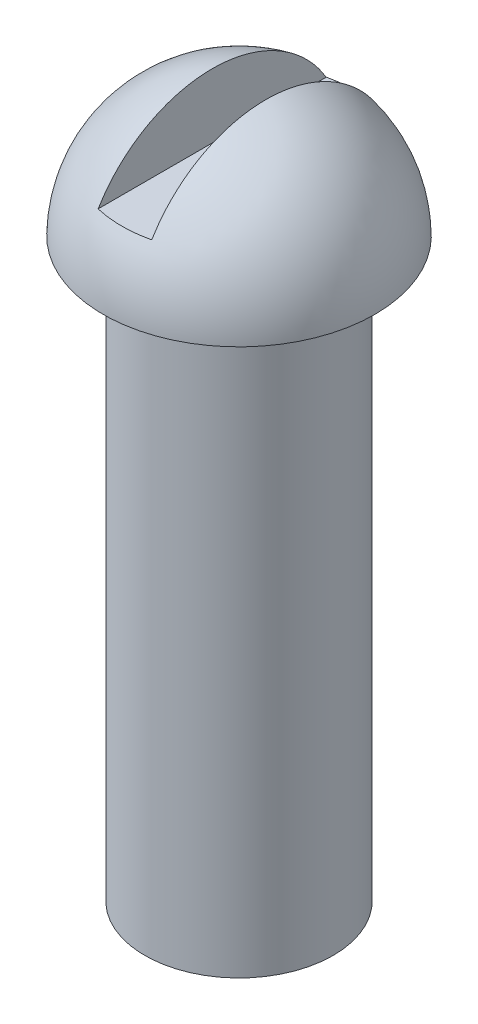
ISO-10303-21;
HEADER;
FILE_DESCRIPTION(('STEP AP214'),'2;1');
FILE_NAME('part.step','',(''),(''),'','','');
FILE_SCHEMA(('AUTOMOTIVE_DESIGN { 1 0 10303 214 1 1 1 1 }'));
ENDSEC;
DATA;
#1=APPLICATION_CONTEXT('core data for automotive mechanical design processes');
#2=APPLICATION_PROTOCOL_DEFINITION('international standard','automotive_design',2000,#1);
#3=PRODUCT_CONTEXT('',#1,'mechanical');
#4=PRODUCT('Part','Part','',(#3));
#5=PRODUCT_RELATED_PRODUCT_CATEGORY('part','',(#4));
#6=PRODUCT_DEFINITION_FORMATION('','',#4);
#7=PRODUCT_DEFINITION_CONTEXT('part definition',#1,'design');
#8=PRODUCT_DEFINITION('design','',#6,#7);
#9=PRODUCT_DEFINITION_SHAPE('','',#8);
#10=(LENGTH_UNIT() NAMED_UNIT(*) SI_UNIT(.MILLI.,.METRE.));
#11=(NAMED_UNIT(*) PLANE_ANGLE_UNIT() SI_UNIT($,.RADIAN.));
#12=(NAMED_UNIT(*) SI_UNIT($,.STERADIAN.) SOLID_ANGLE_UNIT());
#13=UNCERTAINTY_MEASURE_WITH_UNIT(LENGTH_MEASURE(1.E-05),#10,'distance_accuracy_value','');
#14=(GEOMETRIC_REPRESENTATION_CONTEXT(3) GLOBAL_UNCERTAINTY_ASSIGNED_CONTEXT((#13)) GLOBAL_UNIT_ASSIGNED_CONTEXT((#10,
#11,#12)) REPRESENTATION_CONTEXT('',''));
#15=CARTESIAN_POINT('',(0.,0.,0.));
#16=DIRECTION('',(0.,0.,1.));
#17=DIRECTION('',(1.,0.,0.));
#18=AXIS2_PLACEMENT_3D('',#15,#16,#17);
#19=CARTESIAN_POINT('',(0.,-0.0767715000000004,0.));
#20=DIRECTION('',(0.,1.,0.));
#21=DIRECTION('',(1.,0.,0.));
#22=AXIS2_PLACEMENT_3D('',#19,#20,#21);
#23=SPHERICAL_SURFACE('',#22,5.1567715);
#24=CARTESIAN_POINT('',(0.,2.54,0.));
#25=DIRECTION('',(0.,1.,0.));
#26=DIRECTION('',(-1.,0.,0.));
#27=AXIS2_PLACEMENT_3D('',#24,#25,#26);
#28=CIRCLE('',#27,4.44351203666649);
#29=CARTESIAN_POINT('',(-1.016,2.54,-4.32579972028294));
#30=VERTEX_POINT('',#29);
#31=CARTESIAN_POINT('',(1.016,2.54,-4.32579972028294));
#32=VERTEX_POINT('',#31);
#33=EDGE_CURVE('E41',#30,#32,#28,.F.);
#34=ORIENTED_EDGE('',*,*,#33,.T.);
#35=CARTESIAN_POINT('',(1.016,-0.0767715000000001,0.));
#36=DIRECTION('',(1.,0.,0.));
#37=DIRECTION('',(0.,1.,0.));
#38=AXIS2_PLACEMENT_3D('',#35,#36,#37);
#39=CIRCLE('',#38,5.05569345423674);
#40=CARTESIAN_POINT('',(1.016,2.54,4.32579972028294));
#41=VERTEX_POINT('',#40);
#42=EDGE_CURVE('E11',#41,#32,#39,.F.);
#43=ORIENTED_EDGE('',*,*,#42,.F.);
#44=CARTESIAN_POINT('',(-1.016,2.54,4.32579972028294));
#45=VERTEX_POINT('',#44);
#46=EDGE_CURVE('E48',#41,#45,#28,.F.);
#47=ORIENTED_EDGE('',*,*,#46,.T.);
#48=CARTESIAN_POINT('',(-1.016,-0.0767714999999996,0.));
#49=DIRECTION('',(-1.,0.,0.));
#50=DIRECTION('',(0.,-1.,0.));
#51=AXIS2_PLACEMENT_3D('',#48,#49,#50);
#52=CIRCLE('',#51,5.05569345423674);
#53=EDGE_CURVE('E60',#30,#45,#52,.F.);
#54=ORIENTED_EDGE('',*,*,#53,.F.);
#55=EDGE_LOOP('',(#34,#43,#47,#54));
#56=FACE_BOUND('',#55,.T.);
#57=CARTESIAN_POINT('',(0.,0.,0.));
#58=DIRECTION('',(0.,1.,0.));
#59=DIRECTION('',(-1.,0.,0.));
#60=AXIS2_PLACEMENT_3D('',#57,#58,#59);
#61=CIRCLE('',#60,5.1562);
#62=CARTESIAN_POINT('',(-5.1562,0.,0.));
#63=VERTEX_POINT('',#62);
#64=EDGE_CURVE('E65',#63,#63,#61,.T.);
#65=ORIENTED_EDGE('',*,*,#64,.T.);
#66=EDGE_LOOP('',(#65));
#67=FACE_BOUND('',#66,.T.);
#68=ADVANCED_FACE('F34',(#56,#67),#23,.T.);
#69=CARTESIAN_POINT('',(5.1562,0.,0.));
#70=DIRECTION('',(0.,-1.,0.));
#71=DIRECTION('',(1.,0.,0.));
#72=AXIS2_PLACEMENT_3D('',#69,#70,#71);
#73=PLANE('',#72);
#74=CARTESIAN_POINT('',(0.,0.,0.));
#75=DIRECTION('',(0.,1.,0.));
#76=DIRECTION('',(-1.,0.,0.));
#77=AXIS2_PLACEMENT_3D('',#74,#75,#76);
#78=CIRCLE('',#77,3.57187500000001);
#79=CARTESIAN_POINT('',(-3.57187500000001,0.,0.));
#80=VERTEX_POINT('',#79);
#81=EDGE_CURVE('E77',#80,#80,#78,.T.);
#82=ORIENTED_EDGE('',*,*,#81,.T.);
#83=EDGE_LOOP('',(#82));
#84=FACE_BOUND('',#83,.T.);
#85=ORIENTED_EDGE('',*,*,#64,.F.);
#86=EDGE_LOOP('',(#85));
#87=FACE_BOUND('',#86,.T.);
#88=ADVANCED_FACE('F83',(#84,#87),#73,.T.);
#89=CARTESIAN_POINT('',(0.,10.1105238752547,0.));
#90=DIRECTION('',(0.,1.,0.));
#91=DIRECTION('',(-1.,0.,0.));
#92=AXIS2_PLACEMENT_3D('',#89,#90,#91);
#93=CYLINDRICAL_SURFACE('',#92,3.571875);
#94=CARTESIAN_POINT('',(0.,-21.844,0.));
#95=DIRECTION('',(0.,1.,0.));
#96=DIRECTION('',(-1.,0.,0.));
#97=AXIS2_PLACEMENT_3D('',#94,#95,#96);
#98=CIRCLE('',#97,3.571875);
#99=CARTESIAN_POINT('',(-3.571875,-21.844,0.));
#100=VERTEX_POINT('',#99);
#101=EDGE_CURVE('E72',#100,#100,#98,.T.);
#102=ORIENTED_EDGE('',*,*,#101,.T.);
#103=EDGE_LOOP('',(#102));
#104=FACE_BOUND('',#103,.T.);
#105=ORIENTED_EDGE('',*,*,#81,.F.);
#106=EDGE_LOOP('',(#105));
#107=FACE_BOUND('',#106,.T.);
#108=ADVANCED_FACE('F85',(#104,#107),#93,.T.);
#109=CARTESIAN_POINT('',(3.571875,-21.844,0.));
#110=DIRECTION('',(0.,-1.,0.));
#111=DIRECTION('',(1.,0.,0.));
#112=AXIS2_PLACEMENT_3D('',#109,#110,#111);
#113=PLANE('',#112);
#114=ORIENTED_EDGE('',*,*,#101,.F.);
#115=EDGE_LOOP('',(#114));
#116=FACE_BOUND('',#115,.T.);
#117=ADVANCED_FACE('F91',(#116),#113,.T.);
#118=CARTESIAN_POINT('',(1.016,2.54,-5.1562));
#119=DIRECTION('',(1.,0.,0.));
#120=DIRECTION('',(0.,1.,0.));
#121=AXIS2_PLACEMENT_3D('',#118,#119,#120);
#122=PLANE('',#121);
#123=ORIENTED_EDGE('',*,*,#42,.T.);
#124=DIRECTION('',(0.,0.,1.));
#125=VECTOR('',#124,1.);
#126=CARTESIAN_POINT('',(1.016,2.54,-5.1562));
#127=LINE('',#126,#125);
#128=EDGE_CURVE('E69',#32,#41,#127,.T.);
#129=ORIENTED_EDGE('',*,*,#128,.T.);
#130=EDGE_LOOP('',(#123,#129));
#131=FACE_BOUND('',#130,.T.);
#132=ADVANCED_FACE('F97',(#131),#122,.F.);
#133=CARTESIAN_POINT('',(1.016,2.54,-5.1562));
#134=DIRECTION('',(0.,1.,0.));
#135=DIRECTION('',(-1.,0.,0.));
#136=AXIS2_PLACEMENT_3D('',#133,#134,#135);
#137=PLANE('',#136);
#138=DIRECTION('',(0.,0.,1.));
#139=VECTOR('',#138,1.);
#140=CARTESIAN_POINT('',(-1.016,2.54,-5.1562));
#141=LINE('',#140,#139);
#142=EDGE_CURVE('E68',#30,#45,#141,.T.);
#143=ORIENTED_EDGE('',*,*,#142,.T.);
#144=ORIENTED_EDGE('',*,*,#46,.F.);
#145=ORIENTED_EDGE('',*,*,#128,.F.);
#146=ORIENTED_EDGE('',*,*,#33,.F.);
#147=EDGE_LOOP('',(#143,#144,#145,#146));
#148=FACE_BOUND('',#147,.T.);
#149=ADVANCED_FACE('F67',(#148),#137,.T.);
#150=CARTESIAN_POINT('',(-1.016,4.97892195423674,-5.1562));
#151=DIRECTION('',(-1.,0.,0.));
#152=DIRECTION('',(0.,-1.,0.));
#153=AXIS2_PLACEMENT_3D('',#150,#151,#152);
#154=PLANE('',#153);
#155=ORIENTED_EDGE('',*,*,#142,.F.);
#156=ORIENTED_EDGE('',*,*,#53,.T.);
#157=EDGE_LOOP('',(#155,#156));
#158=FACE_BOUND('',#157,.T.);
#159=ADVANCED_FACE('F70',(#158),#154,.F.);
#160=CLOSED_SHELL('',(#68,#88,#108,#117,#132,#149,#159));
#161=MANIFOLD_SOLID_BREP('B2',#160);
#162=ADVANCED_BREP_SHAPE_REPRESENTATION('',(#18,#161),#14);
#163=SHAPE_DEFINITION_REPRESENTATION(#9,#162);
ENDSEC;
END-ISO-10303-21;
